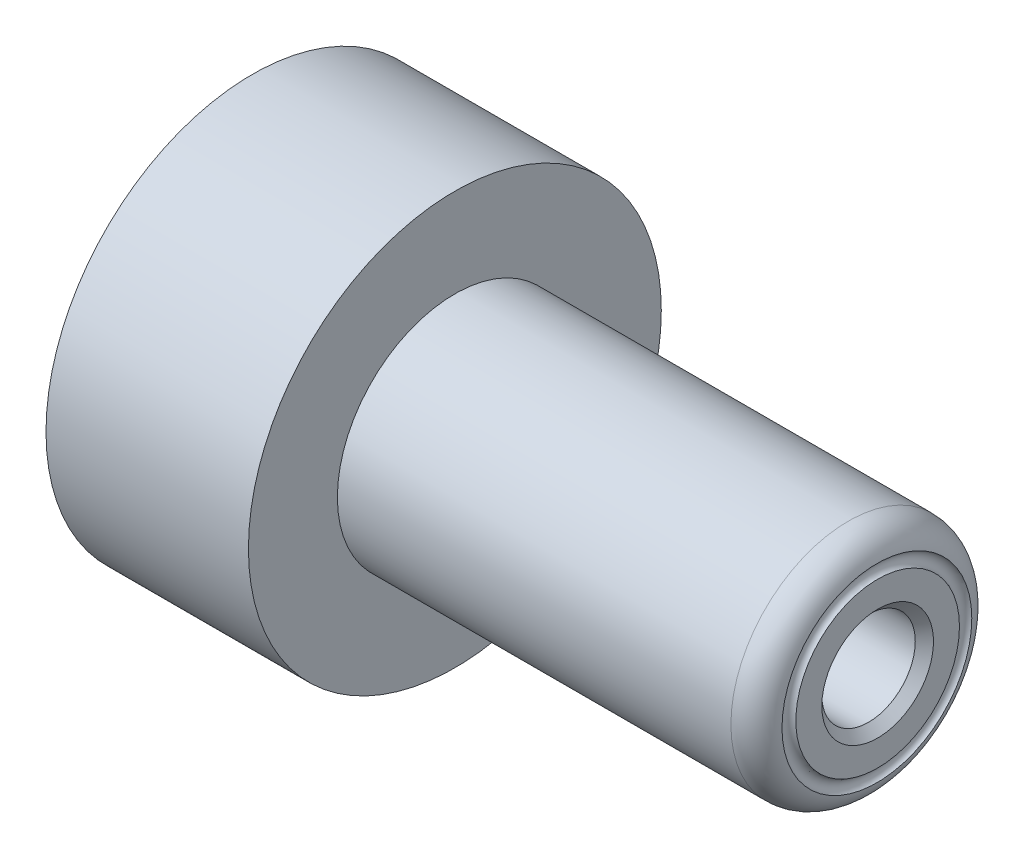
from build123d import *

# Parameters (mm, degrees)
SKETCH2_R          = 1.2065
CUT_EXTRUDE1_DEPTH = 2.54
SKETCH3_R          = 2.515
CUT_EXTRUDE2_DEPTH = 38.143429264
CHAMFER1_SIZE      = 0.49
SKETCH4_R          = 0.381


with BuildPart() as part:
    # Sketch1 → Revolve1 (revolve)
    with BuildSketch(Plane.XY, mode=Mode.PRIVATE) as revolve1_sk:
        with BuildLine():
            Line((0, 3.9751), (0, 11.1125))
            Line((0, 11.1125), (10.8966, 11.1125))
            Line((10.8966, 11.1125), (10.8966, 6.3246))
            Line((10.8966, 6.3246), (32.0802, 6.3246))
            ThreePointArc((32.0802, 6.3246), (33.193751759, 5.863351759), (33.655, 4.7498))
            Line((33.655, 4.7498), (33.655, 0))
            Line((33.655, 0), (21.8948, 0))
            Line((21.8948, 0), (21.8948, 3.9751))
            Line((21.8948, 3.9751), (0, 3.9751))
        make_face()
    revolve(revolve1_sk.sketch.rotate(Axis((0, 0, 0), (1, 0, 0)), 90), axis=Axis((0, 0, 0), (1, 0, 0)))

    # Sketch2 → Cut-Extrude1 (cut)
    with BuildSketch(Plane.ZY):
        with Locations((-6.7437, 0)):
            Circle(SKETCH2_R)
        with Locations(Location((6.7437, 0, 0), (0, 0, 180))):
            Circle(SKETCH2_R)
    extrude(amount=-CUT_EXTRUDE1_DEPTH, mode=Mode.SUBTRACT)

    # Sketch3 → Cut-Extrude2 (cut, through all)
    with BuildSketch(Plane(origin=(33.655, 0, 0), x_dir=(0, 0, -1), z_dir=(1, 0, 0))):
        Circle(SKETCH3_R)
    extrude(amount=-CUT_EXTRUDE2_DEPTH, mode=Mode.SUBTRACT)

    # Chamfer1
    chamfer1_edges = [part.edges().sort_by_distance(p)[0] for p in [
        (33.655, 0, 2.515),
    ]]
    chamfer(chamfer1_edges, length=CHAMFER1_SIZE)

    # Sketch4 → Cut-Revolve1 (revolve, cut)
    with BuildSketch(Plane.XY, mode=Mode.PRIVATE) as cut_revolve1_sk:
        with Locations((33.778, 4.765)):
            Circle(SKETCH4_R)
    revolve(cut_revolve1_sk.sketch.rotate(Axis((0, 0, 0), (1, 0, 0)), 90), axis=Axis((0, 0, 0), (1, 0, 0)), mode=Mode.SUBTRACT)


solid = part.part
